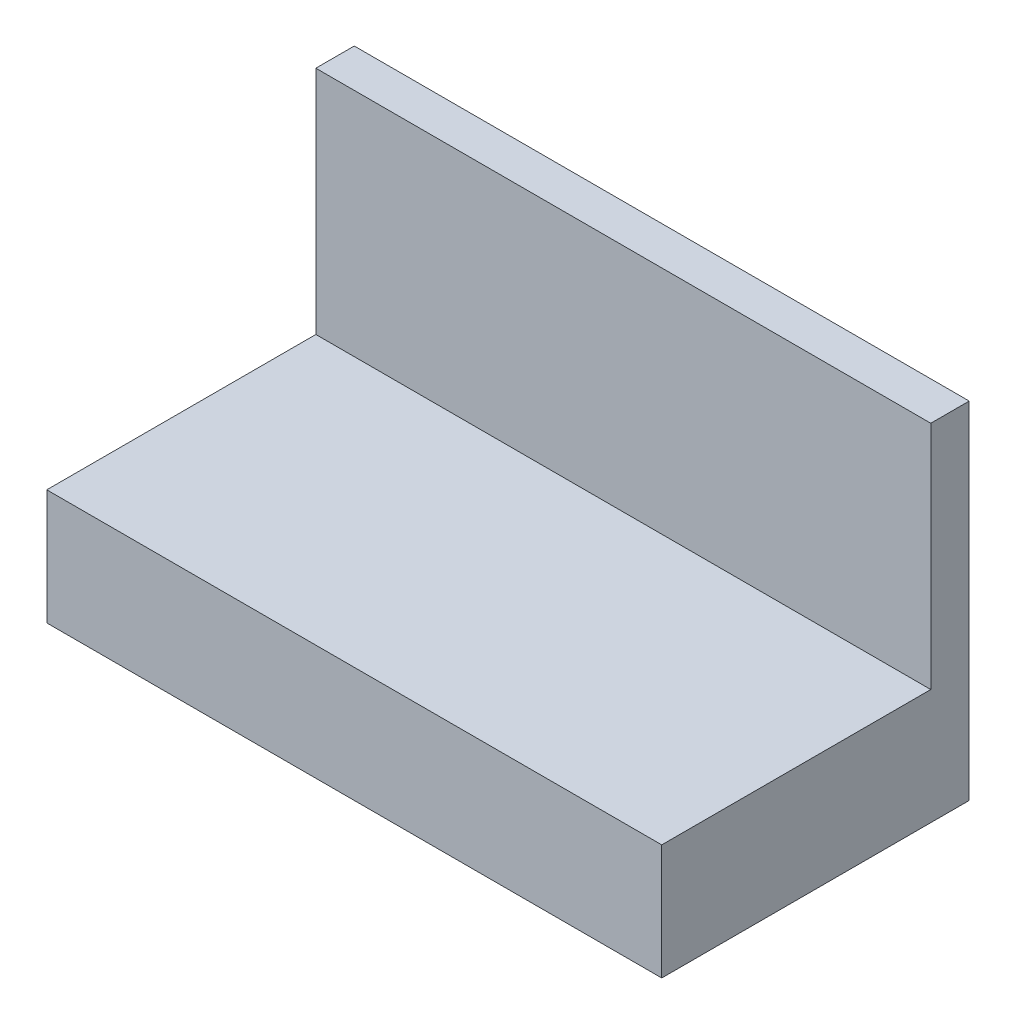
ISO-10303-21;
HEADER;
FILE_DESCRIPTION(('STEP AP214'),'2;1');
FILE_NAME('part.step','',(''),(''),'','','');
FILE_SCHEMA(('AUTOMOTIVE_DESIGN { 1 0 10303 214 1 1 1 1 }'));
ENDSEC;
DATA;
#1=APPLICATION_CONTEXT('core data for automotive mechanical design processes');
#2=APPLICATION_PROTOCOL_DEFINITION('international standard','automotive_design',2000,#1);
#3=PRODUCT_CONTEXT('',#1,'mechanical');
#4=PRODUCT('Part','Part','',(#3));
#5=PRODUCT_RELATED_PRODUCT_CATEGORY('part','',(#4));
#6=PRODUCT_DEFINITION_FORMATION('','',#4);
#7=PRODUCT_DEFINITION_CONTEXT('part definition',#1,'design');
#8=PRODUCT_DEFINITION('design','',#6,#7);
#9=PRODUCT_DEFINITION_SHAPE('','',#8);
#10=(LENGTH_UNIT() NAMED_UNIT(*) SI_UNIT(.MILLI.,.METRE.));
#11=(NAMED_UNIT(*) PLANE_ANGLE_UNIT() SI_UNIT($,.RADIAN.));
#12=(NAMED_UNIT(*) SI_UNIT($,.STERADIAN.) SOLID_ANGLE_UNIT());
#13=UNCERTAINTY_MEASURE_WITH_UNIT(LENGTH_MEASURE(1.E-05),#10,'distance_accuracy_value','');
#14=(GEOMETRIC_REPRESENTATION_CONTEXT(3) GLOBAL_UNCERTAINTY_ASSIGNED_CONTEXT((#13)) GLOBAL_UNIT_ASSIGNED_CONTEXT((#10,
#11,#12)) REPRESENTATION_CONTEXT('',''));
#15=CARTESIAN_POINT('',(0.,0.,0.));
#16=DIRECTION('',(0.,0.,1.));
#17=DIRECTION('',(1.,0.,0.));
#18=AXIS2_PLACEMENT_3D('',#15,#16,#17);
#19=CARTESIAN_POINT('',(-1.,2.,-1.));
#20=DIRECTION('',(0.,1.,0.));
#21=DIRECTION('',(0.,0.,1.));
#22=AXIS2_PLACEMENT_3D('',#19,#20,#21);
#23=PLANE('',#22);
#24=DIRECTION('',(0.,0.,1.));
#25=VECTOR('',#24,1.);
#26=CARTESIAN_POINT('',(-1.,2.,-1.));
#27=LINE('',#26,#25);
#28=CARTESIAN_POINT('',(-0.999999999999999,2.,-7.));
#29=VERTEX_POINT('',#28);
#30=CARTESIAN_POINT('',(-1.,2.,-1.));
#31=VERTEX_POINT('',#30);
#32=EDGE_CURVE('E195',#29,#31,#27,.T.);
#33=ORIENTED_EDGE('',*,*,#32,.T.);
#34=DIRECTION('',(-1.,0.,0.));
#35=VECTOR('',#34,1.);
#36=CARTESIAN_POINT('',(-1.,2.,-1.));
#37=LINE('',#36,#35);
#38=CARTESIAN_POINT('',(-15.,2.,-1.));
#39=VERTEX_POINT('',#38);
#40=EDGE_CURVE('E197',#31,#39,#37,.T.);
#41=ORIENTED_EDGE('',*,*,#40,.T.);
#42=DIRECTION('',(0.,0.,-1.));
#43=VECTOR('',#42,1.);
#44=CARTESIAN_POINT('',(-15.,2.,-1.));
#45=LINE('',#44,#43);
#46=CARTESIAN_POINT('',(-15.,2.,-7.));
#47=VERTEX_POINT('',#46);
#48=EDGE_CURVE('E201',#39,#47,#45,.T.);
#49=ORIENTED_EDGE('',*,*,#48,.T.);
#50=DIRECTION('',(1.,0.,0.));
#51=VECTOR('',#50,1.);
#52=CARTESIAN_POINT('',(-0.999999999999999,2.,-7.));
#53=LINE('',#52,#51);
#54=EDGE_CURVE('E204',#47,#29,#53,.T.);
#55=ORIENTED_EDGE('',*,*,#54,.T.);
#56=EDGE_LOOP('',(#33,#41,#49,#55));
#57=FACE_BOUND('',#56,.T.);
#58=CARTESIAN_POINT('',(-8.,2.,-4.));
#59=DIRECTION('',(0.,1.,0.));
#60=DIRECTION('',(0.,0.,1.));
#61=AXIS2_PLACEMENT_3D('',#58,#59,#60);
#62=CIRCLE('',#61,1.5);
#63=CARTESIAN_POINT('',(-8.,2.,-2.5));
#64=VERTEX_POINT('',#63);
#65=EDGE_CURVE('E11',#64,#64,#62,.F.);
#66=ORIENTED_EDGE('',*,*,#65,.F.);
#67=EDGE_LOOP('',(#66));
#68=FACE_BOUND('',#67,.T.);
#69=ADVANCED_FACE('F32',(#57,#68),#23,.F.);
#70=CARTESIAN_POINT('',(-16.,0.,-8.));
#71=DIRECTION('',(0.,-1.,0.));
#72=DIRECTION('',(0.,0.,-1.));
#73=AXIS2_PLACEMENT_3D('',#70,#71,#72);
#74=PLANE('',#73);
#75=DIRECTION('',(0.,0.,1.));
#76=VECTOR('',#75,1.);
#77=CARTESIAN_POINT('',(-1.,0.,-1.));
#78=LINE('',#77,#76);
#79=CARTESIAN_POINT('',(-0.999999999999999,0.,-7.));
#80=VERTEX_POINT('',#79);
#81=CARTESIAN_POINT('',(-0.999999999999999,0.,-1.));
#82=VERTEX_POINT('',#81);
#83=EDGE_CURVE('E47',#80,#82,#78,.T.);
#84=ORIENTED_EDGE('',*,*,#83,.F.);
#85=DIRECTION('',(1.,0.,0.));
#86=VECTOR('',#85,1.);
#87=CARTESIAN_POINT('',(-0.999999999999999,0.,-7.));
#88=LINE('',#87,#86);
#89=CARTESIAN_POINT('',(-15.,0.,-7.));
#90=VERTEX_POINT('',#89);
#91=EDGE_CURVE('E198',#90,#80,#88,.T.);
#92=ORIENTED_EDGE('',*,*,#91,.F.);
#93=DIRECTION('',(0.,0.,-1.));
#94=VECTOR('',#93,1.);
#95=CARTESIAN_POINT('',(-15.,0.,-1.));
#96=LINE('',#95,#94);
#97=CARTESIAN_POINT('',(-15.,0.,-1.));
#98=VERTEX_POINT('',#97);
#99=EDGE_CURVE('E212',#98,#90,#96,.T.);
#100=ORIENTED_EDGE('',*,*,#99,.F.);
#101=DIRECTION('',(-1.,0.,0.));
#102=VECTOR('',#101,1.);
#103=CARTESIAN_POINT('',(-1.,0.,-1.));
#104=LINE('',#103,#102);
#105=EDGE_CURVE('E209',#82,#98,#104,.T.);
#106=ORIENTED_EDGE('',*,*,#105,.F.);
#107=EDGE_LOOP('',(#84,#92,#100,#106));
#108=FACE_BOUND('',#107,.T.);
#109=DIRECTION('',(0.,0.,-1.));
#110=VECTOR('',#109,1.);
#111=CARTESIAN_POINT('',(0.,0.,-8.));
#112=LINE('',#111,#110);
#113=CARTESIAN_POINT('',(0.,0.,0.));
#114=VERTEX_POINT('',#113);
#115=CARTESIAN_POINT('',(0.,0.,-8.));
#116=VERTEX_POINT('',#115);
#117=EDGE_CURVE('E131',#114,#116,#112,.T.);
#118=ORIENTED_EDGE('',*,*,#117,.F.);
#119=DIRECTION('',(1.,0.,0.));
#120=VECTOR('',#119,1.);
#121=CARTESIAN_POINT('',(-16.,0.,0.));
#122=LINE('',#121,#120);
#123=CARTESIAN_POINT('',(-16.,0.,0.));
#124=VERTEX_POINT('',#123);
#125=EDGE_CURVE('E40',#124,#114,#122,.T.);
#126=ORIENTED_EDGE('',*,*,#125,.F.);
#127=DIRECTION('',(0.,0.,-1.));
#128=VECTOR('',#127,1.);
#129=CARTESIAN_POINT('',(-16.,0.,-8.));
#130=LINE('',#129,#128);
#131=CARTESIAN_POINT('',(-16.,0.,-8.));
#132=VERTEX_POINT('',#131);
#133=EDGE_CURVE('E147',#124,#132,#130,.T.);
#134=ORIENTED_EDGE('',*,*,#133,.T.);
#135=DIRECTION('',(1.,0.,0.));
#136=VECTOR('',#135,1.);
#137=CARTESIAN_POINT('',(-16.,0.,-8.));
#138=LINE('',#137,#136);
#139=EDGE_CURVE('E88',#132,#116,#138,.T.);
#140=ORIENTED_EDGE('',*,*,#139,.T.);
#141=EDGE_LOOP('',(#118,#126,#134,#140));
#142=FACE_BOUND('',#141,.T.);
#143=ADVANCED_FACE('F34',(#108,#142),#74,.T.);
#144=CARTESIAN_POINT('',(-16.,0.,0.));
#145=DIRECTION('',(0.,0.,1.));
#146=DIRECTION('',(1.,0.,0.));
#147=AXIS2_PLACEMENT_3D('',#144,#145,#146);
#148=PLANE('',#147);
#149=DIRECTION('',(0.,-1.,0.));
#150=VECTOR('',#149,1.);
#151=CARTESIAN_POINT('',(0.,0.,0.));
#152=LINE('',#151,#150);
#153=CARTESIAN_POINT('',(0.,2.99999999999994,0.));
#154=VERTEX_POINT('',#153);
#155=EDGE_CURVE('E144',#154,#114,#152,.T.);
#156=ORIENTED_EDGE('',*,*,#155,.F.);
#157=DIRECTION('',(1.,0.,0.));
#158=VECTOR('',#157,1.);
#159=CARTESIAN_POINT('',(-16.,2.99999999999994,0.));
#160=LINE('',#159,#158);
#161=CARTESIAN_POINT('',(-16.,2.99999999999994,0.));
#162=VERTEX_POINT('',#161);
#163=EDGE_CURVE('E111',#162,#154,#160,.T.);
#164=ORIENTED_EDGE('',*,*,#163,.F.);
#165=DIRECTION('',(0.,-1.,0.));
#166=VECTOR('',#165,1.);
#167=CARTESIAN_POINT('',(-16.,0.,0.));
#168=LINE('',#167,#166);
#169=EDGE_CURVE('E121',#162,#124,#168,.T.);
#170=ORIENTED_EDGE('',*,*,#169,.T.);
#171=ORIENTED_EDGE('',*,*,#125,.T.);
#172=EDGE_LOOP('',(#156,#164,#170,#171));
#173=FACE_BOUND('',#172,.T.);
#174=ADVANCED_FACE('F154',(#173),#148,.T.);
#175=CARTESIAN_POINT('',(-16.,3.,-1.));
#176=DIRECTION('',(0.,1.,0.));
#177=DIRECTION('',(0.,0.,1.));
#178=AXIS2_PLACEMENT_3D('',#175,#176,#177);
#179=PLANE('',#178);
#180=DIRECTION('',(0.,0.,1.));
#181=VECTOR('',#180,1.);
#182=CARTESIAN_POINT('',(0.,3.,-1.));
#183=LINE('',#182,#181);
#184=CARTESIAN_POINT('',(0.,3.,-7.));
#185=VERTEX_POINT('',#184);
#186=EDGE_CURVE('E106',#185,#154,#183,.T.);
#187=ORIENTED_EDGE('',*,*,#186,.F.);
#188=DIRECTION('',(1.,0.,0.));
#189=VECTOR('',#188,1.);
#190=CARTESIAN_POINT('',(-16.,3.,-7.));
#191=LINE('',#190,#189);
#192=CARTESIAN_POINT('',(-16.,3.,-7.));
#193=VERTEX_POINT('',#192);
#194=EDGE_CURVE('E100',#193,#185,#191,.T.);
#195=ORIENTED_EDGE('',*,*,#194,.F.);
#196=DIRECTION('',(0.,0.,1.));
#197=VECTOR('',#196,1.);
#198=CARTESIAN_POINT('',(-16.,3.,-1.));
#199=LINE('',#198,#197);
#200=EDGE_CURVE('E103',#193,#162,#199,.T.);
#201=ORIENTED_EDGE('',*,*,#200,.T.);
#202=ORIENTED_EDGE('',*,*,#163,.T.);
#203=EDGE_LOOP('',(#187,#195,#201,#202));
#204=FACE_BOUND('',#203,.T.);
#205=ADVANCED_FACE('F102',(#204),#179,.T.);
#206=CARTESIAN_POINT('',(-16.,3.,-7.));
#207=DIRECTION('',(0.,0.,1.));
#208=DIRECTION('',(0.,-1.,0.));
#209=AXIS2_PLACEMENT_3D('',#206,#207,#208);
#210=PLANE('',#209);
#211=DIRECTION('',(0.,-1.,0.));
#212=VECTOR('',#211,1.);
#213=CARTESIAN_POINT('',(0.,3.,-7.));
#214=LINE('',#213,#212);
#215=CARTESIAN_POINT('',(0.,9.,-7.));
#216=VERTEX_POINT('',#215);
#217=EDGE_CURVE('E141',#216,#185,#214,.T.);
#218=ORIENTED_EDGE('',*,*,#217,.F.);
#219=DIRECTION('',(1.,0.,0.));
#220=VECTOR('',#219,1.);
#221=CARTESIAN_POINT('',(-16.,9.,-7.));
#222=LINE('',#221,#220);
#223=CARTESIAN_POINT('',(-16.,9.,-7.));
#224=VERTEX_POINT('',#223);
#225=EDGE_CURVE('E112',#224,#216,#222,.T.);
#226=ORIENTED_EDGE('',*,*,#225,.F.);
#227=DIRECTION('',(0.,-1.,0.));
#228=VECTOR('',#227,1.);
#229=CARTESIAN_POINT('',(-16.,3.,-7.));
#230=LINE('',#229,#228);
#231=EDGE_CURVE('E119',#224,#193,#230,.T.);
#232=ORIENTED_EDGE('',*,*,#231,.T.);
#233=ORIENTED_EDGE('',*,*,#194,.T.);
#234=EDGE_LOOP('',(#218,#226,#232,#233));
#235=FACE_BOUND('',#234,.T.);
#236=ADVANCED_FACE('F123',(#235),#210,.T.);
#237=CARTESIAN_POINT('',(-16.,9.,-7.));
#238=DIRECTION('',(0.,1.,0.));
#239=DIRECTION('',(0.,0.,1.));
#240=AXIS2_PLACEMENT_3D('',#237,#238,#239);
#241=PLANE('',#240);
#242=DIRECTION('',(0.,0.,1.));
#243=VECTOR('',#242,1.);
#244=CARTESIAN_POINT('',(0.,9.,-7.));
#245=LINE('',#244,#243);
#246=CARTESIAN_POINT('',(0.,9.,-8.));
#247=VERTEX_POINT('',#246);
#248=EDGE_CURVE('E138',#247,#216,#245,.T.);
#249=ORIENTED_EDGE('',*,*,#248,.F.);
#250=DIRECTION('',(1.,0.,0.));
#251=VECTOR('',#250,1.);
#252=CARTESIAN_POINT('',(-16.,9.,-8.));
#253=LINE('',#252,#251);
#254=CARTESIAN_POINT('',(-16.,9.,-8.));
#255=VERTEX_POINT('',#254);
#256=EDGE_CURVE('E151',#255,#247,#253,.T.);
#257=ORIENTED_EDGE('',*,*,#256,.F.);
#258=DIRECTION('',(0.,0.,1.));
#259=VECTOR('',#258,1.);
#260=CARTESIAN_POINT('',(-16.,9.,-7.));
#261=LINE('',#260,#259);
#262=EDGE_CURVE('E124',#255,#224,#261,.T.);
#263=ORIENTED_EDGE('',*,*,#262,.T.);
#264=ORIENTED_EDGE('',*,*,#225,.T.);
#265=EDGE_LOOP('',(#249,#257,#263,#264));
#266=FACE_BOUND('',#265,.T.);
#267=ADVANCED_FACE('F229',(#266),#241,.T.);
#268=CARTESIAN_POINT('',(-16.,9.,-8.));
#269=DIRECTION('',(0.,0.,-1.));
#270=DIRECTION('',(-1.,0.,0.));
#271=AXIS2_PLACEMENT_3D('',#268,#269,#270);
#272=PLANE('',#271);
#273=DIRECTION('',(0.,1.,0.));
#274=VECTOR('',#273,1.);
#275=CARTESIAN_POINT('',(0.,9.,-8.));
#276=LINE('',#275,#274);
#277=EDGE_CURVE('E134',#116,#247,#276,.T.);
#278=ORIENTED_EDGE('',*,*,#277,.F.);
#279=ORIENTED_EDGE('',*,*,#139,.F.);
#280=DIRECTION('',(0.,1.,0.));
#281=VECTOR('',#280,1.);
#282=CARTESIAN_POINT('',(-16.,2.44484776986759,-8.));
#283=LINE('',#282,#281);
#284=EDGE_CURVE('E126',#132,#255,#283,.T.);
#285=ORIENTED_EDGE('',*,*,#284,.T.);
#286=ORIENTED_EDGE('',*,*,#256,.T.);
#287=EDGE_LOOP('',(#278,#279,#285,#286));
#288=FACE_BOUND('',#287,.T.);
#289=ADVANCED_FACE('F226',(#288),#272,.T.);
#290=CARTESIAN_POINT('',(-16.,0.,0.));
#291=DIRECTION('',(-1.,0.,0.));
#292=DIRECTION('',(0.,0.,1.));
#293=AXIS2_PLACEMENT_3D('',#290,#291,#292);
#294=PLANE('',#293);
#295=ORIENTED_EDGE('',*,*,#133,.F.);
#296=ORIENTED_EDGE('',*,*,#169,.F.);
#297=ORIENTED_EDGE('',*,*,#200,.F.);
#298=ORIENTED_EDGE('',*,*,#231,.F.);
#299=ORIENTED_EDGE('',*,*,#262,.F.);
#300=ORIENTED_EDGE('',*,*,#284,.F.);
#301=EDGE_LOOP('',(#295,#296,#297,#298,#299,#300));
#302=FACE_BOUND('',#301,.T.);
#303=ADVANCED_FACE('F117',(#302),#294,.T.);
#304=CARTESIAN_POINT('',(0.,0.,0.));
#305=DIRECTION('',(-1.,0.,0.));
#306=DIRECTION('',(0.,0.,1.));
#307=AXIS2_PLACEMENT_3D('',#304,#305,#306);
#308=PLANE('',#307);
#309=ORIENTED_EDGE('',*,*,#117,.T.);
#310=ORIENTED_EDGE('',*,*,#277,.T.);
#311=ORIENTED_EDGE('',*,*,#248,.T.);
#312=ORIENTED_EDGE('',*,*,#217,.T.);
#313=ORIENTED_EDGE('',*,*,#186,.T.);
#314=ORIENTED_EDGE('',*,*,#155,.T.);
#315=EDGE_LOOP('',(#309,#310,#311,#312,#313,#314));
#316=FACE_BOUND('',#315,.T.);
#317=ADVANCED_FACE('F153',(#316),#308,.F.);
#318=CARTESIAN_POINT('',(-1.,2.,-1.));
#319=DIRECTION('',(1.,0.,0.));
#320=DIRECTION('',(0.,0.,-1.));
#321=AXIS2_PLACEMENT_3D('',#318,#319,#320);
#322=PLANE('',#321);
#323=ORIENTED_EDGE('',*,*,#83,.T.);
#324=DIRECTION('',(0.,-1.,0.));
#325=VECTOR('',#324,1.);
#326=CARTESIAN_POINT('',(-1.,2.,-1.));
#327=LINE('',#326,#325);
#328=EDGE_CURVE('E207',#31,#82,#327,.T.);
#329=ORIENTED_EDGE('',*,*,#328,.F.);
#330=ORIENTED_EDGE('',*,*,#32,.F.);
#331=DIRECTION('',(0.,-1.,0.));
#332=VECTOR('',#331,1.);
#333=CARTESIAN_POINT('',(-0.999999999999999,2.,-7.));
#334=LINE('',#333,#332);
#335=EDGE_CURVE('E135',#29,#80,#334,.T.);
#336=ORIENTED_EDGE('',*,*,#335,.T.);
#337=EDGE_LOOP('',(#323,#329,#330,#336));
#338=FACE_BOUND('',#337,.T.);
#339=ADVANCED_FACE('F266',(#338),#322,.F.);
#340=CARTESIAN_POINT('',(-0.999999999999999,2.,-7.));
#341=DIRECTION('',(0.,0.,-1.));
#342=DIRECTION('',(0.,1.,0.));
#343=AXIS2_PLACEMENT_3D('',#340,#341,#342);
#344=PLANE('',#343);
#345=ORIENTED_EDGE('',*,*,#91,.T.);
#346=ORIENTED_EDGE('',*,*,#335,.F.);
#347=ORIENTED_EDGE('',*,*,#54,.F.);
#348=DIRECTION('',(0.,-1.,0.));
#349=VECTOR('',#348,1.);
#350=CARTESIAN_POINT('',(-15.,2.,-7.));
#351=LINE('',#350,#349);
#352=EDGE_CURVE('E218',#47,#90,#351,.T.);
#353=ORIENTED_EDGE('',*,*,#352,.T.);
#354=EDGE_LOOP('',(#345,#346,#347,#353));
#355=FACE_BOUND('',#354,.T.);
#356=ADVANCED_FACE('F271',(#355),#344,.F.);
#357=CARTESIAN_POINT('',(-15.,2.,-1.));
#358=DIRECTION('',(-1.,0.,0.));
#359=DIRECTION('',(0.,0.,1.));
#360=AXIS2_PLACEMENT_3D('',#357,#358,#359);
#361=PLANE('',#360);
#362=ORIENTED_EDGE('',*,*,#99,.T.);
#363=ORIENTED_EDGE('',*,*,#352,.F.);
#364=ORIENTED_EDGE('',*,*,#48,.F.);
#365=DIRECTION('',(0.,-1.,0.));
#366=VECTOR('',#365,1.);
#367=CARTESIAN_POINT('',(-15.,2.,-1.));
#368=LINE('',#367,#366);
#369=EDGE_CURVE('E221',#39,#98,#368,.T.);
#370=ORIENTED_EDGE('',*,*,#369,.T.);
#371=EDGE_LOOP('',(#362,#363,#364,#370));
#372=FACE_BOUND('',#371,.T.);
#373=ADVANCED_FACE('F280',(#372),#361,.F.);
#374=CARTESIAN_POINT('',(-1.,2.,-1.));
#375=DIRECTION('',(0.,0.,1.));
#376=DIRECTION('',(0.,-1.,0.));
#377=AXIS2_PLACEMENT_3D('',#374,#375,#376);
#378=PLANE('',#377);
#379=ORIENTED_EDGE('',*,*,#105,.T.);
#380=ORIENTED_EDGE('',*,*,#369,.F.);
#381=ORIENTED_EDGE('',*,*,#40,.F.);
#382=ORIENTED_EDGE('',*,*,#328,.T.);
#383=EDGE_LOOP('',(#379,#380,#381,#382));
#384=FACE_BOUND('',#383,.T.);
#385=ADVANCED_FACE('F289',(#384),#378,.F.);
#386=CARTESIAN_POINT('',(-8.,0.,-4.));
#387=DIRECTION('',(0.,-1.,0.));
#388=DIRECTION('',(0.,0.,-1.));
#389=AXIS2_PLACEMENT_3D('',#386,#387,#388);
#390=PLANE('',#389);
#391=CARTESIAN_POINT('',(-8.,0.,-4.));
#392=DIRECTION('',(0.,-1.,0.));
#393=DIRECTION('',(0.,0.,-1.));
#394=AXIS2_PLACEMENT_3D('',#391,#392,#393);
#395=CIRCLE('',#394,1.5);
#396=CARTESIAN_POINT('',(-8.,0.,-5.5));
#397=VERTEX_POINT('',#396);
#398=EDGE_CURVE('E190',#397,#397,#395,.T.);
#399=ORIENTED_EDGE('',*,*,#398,.T.);
#400=EDGE_LOOP('',(#399));
#401=FACE_BOUND('',#400,.T.);
#402=CARTESIAN_POINT('',(-8.,0.,-4.));
#403=DIRECTION('',(0.,-1.,0.));
#404=DIRECTION('',(0.,0.,-1.));
#405=AXIS2_PLACEMENT_3D('',#402,#403,#404);
#406=CIRCLE('',#405,1.);
#407=CARTESIAN_POINT('',(-8.,0.,-5.));
#408=VERTEX_POINT('',#407);
#409=EDGE_CURVE('E187',#408,#408,#406,.T.);
#410=ORIENTED_EDGE('',*,*,#409,.F.);
#411=EDGE_LOOP('',(#410));
#412=FACE_BOUND('',#411,.T.);
#413=ADVANCED_FACE('F298',(#401,#412),#390,.T.);
#414=CARTESIAN_POINT('',(-8.,0.,-4.));
#415=DIRECTION('',(0.,1.,0.));
#416=DIRECTION('',(0.,0.,1.));
#417=AXIS2_PLACEMENT_3D('',#414,#415,#416);
#418=CYLINDRICAL_SURFACE('',#417,1.5);
#419=ORIENTED_EDGE('',*,*,#398,.F.);
#420=EDGE_LOOP('',(#419));
#421=FACE_BOUND('',#420,.T.);
#422=ORIENTED_EDGE('',*,*,#65,.T.);
#423=EDGE_LOOP('',(#422));
#424=FACE_BOUND('',#423,.T.);
#425=ADVANCED_FACE('F180',(#421,#424),#418,.T.);
#426=CARTESIAN_POINT('',(-8.,0.,-4.));
#427=DIRECTION('',(0.,1.,0.));
#428=DIRECTION('',(0.,0.,1.));
#429=AXIS2_PLACEMENT_3D('',#426,#427,#428);
#430=CYLINDRICAL_SURFACE('',#429,1.);
#431=ORIENTED_EDGE('',*,*,#409,.T.);
#432=EDGE_LOOP('',(#431));
#433=FACE_BOUND('',#432,.T.);
#434=CARTESIAN_POINT('',(-8.,2.,-4.));
#435=DIRECTION('',(0.,-1.,0.));
#436=DIRECTION('',(0.,0.,-1.));
#437=AXIS2_PLACEMENT_3D('',#434,#435,#436);
#438=CIRCLE('',#437,1.);
#439=CARTESIAN_POINT('',(-8.,2.,-5.));
#440=VERTEX_POINT('',#439);
#441=EDGE_CURVE('E185',#440,#440,#438,.T.);
#442=ORIENTED_EDGE('',*,*,#441,.F.);
#443=EDGE_LOOP('',(#442));
#444=FACE_BOUND('',#443,.T.);
#445=ADVANCED_FACE('F175',(#433,#444),#430,.F.);
#446=ORIENTED_EDGE('',*,*,#441,.T.);
#447=EDGE_LOOP('',(#446));
#448=FACE_BOUND('',#447,.T.);
#449=ADVANCED_FACE('F167',(#448),#23,.F.);
#450=CLOSED_SHELL('',(#69,#143,#174,#205,#236,#267,#289,#303,#317,#339,#356,#373,#385,#413,#425,
#445,#449));
#451=MANIFOLD_SOLID_BREP('B2',#450);
#452=ADVANCED_BREP_SHAPE_REPRESENTATION('',(#18,#451),#14);
#453=SHAPE_DEFINITION_REPRESENTATION(#9,#452);
ENDSEC;
END-ISO-10303-21;
